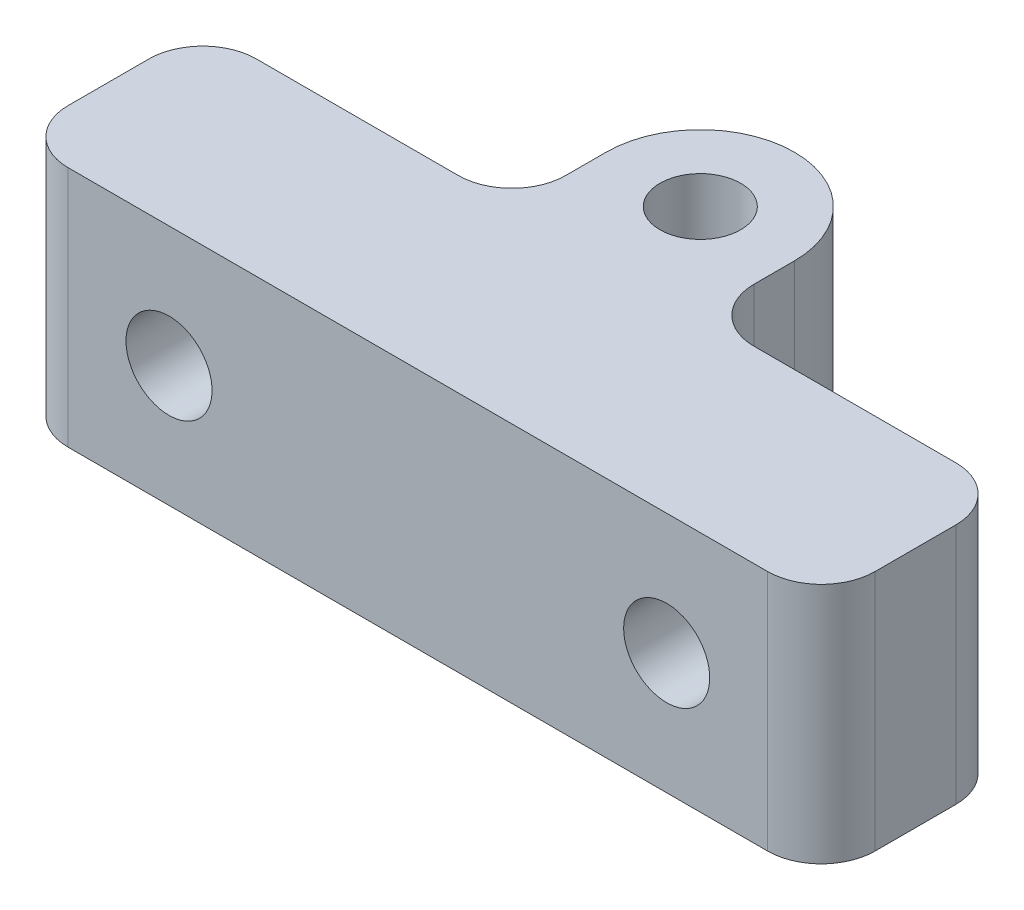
from build123d import *

# Parameters (mm, degrees)
SKETCH1_R           = 1.5
BOSS_EXTRUDE1_DEPTH = 9
FILLET1_R           = 2
SKETCH2_R           = 1.6
CUT_EXTRUDE1_DEPTH  = 19.841443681


with BuildPart() as part:
    # Sketch1 → Boss-Extrude1 (new body)
    with BuildSketch(Plane(origin=(0, 0, 0), x_dir=(1, 0, 0), z_dir=(0, 1, 0))):
        with BuildLine():
            Line((-15, -10.5), (15, -10.5))
            Line((15, -10.5), (15, -3.5))
            Line((15, -3.5), (3.5, -3.5))
            Line((3.5, -3.5), (3.5, 0))
            ThreePointArc((3.5, 0), (0, 3.5), (-3.5, 0))
            Line((-3.5, 0), (-3.5, -3.5))
            Line((-3.5, -3.5), (-15, -3.5))
            Line((-15, -3.5), (-15, -10.5))
        make_face()
        with Locations(Location((0, 0, 0), (0, 0, 270))):
            Circle(SKETCH1_R, mode=Mode.SUBTRACT)
    extrude(amount=BOSS_EXTRUDE1_DEPTH)

    # Fillet1
    fillet1_edges = [part.edges().sort_by_distance(p)[0] for p in [
        (-15, 4.5, 3.5),
        (-3.5, 4.5, 3.5),
        (3.5, 4.5, 3.5),
        (15, 4.5, 3.5),
        (15, 4.5, 10.5),
        (-15, 4.5, 10.5),
    ]]
    fillet(fillet1_edges, radius=FILLET1_R)

    # Sketch2 → Cut-Extrude1 (cut, through all)
    with BuildSketch(Plane(origin=(0, 0, 3.5), x_dir=(-1, 0, 0), z_dir=(0, 0, -1))):
        with Locations((-9.25, 4.5)):
            Circle(SKETCH2_R)
        with Locations((9.25, 4.5)):
            Circle(SKETCH2_R)
    extrude(amount=-CUT_EXTRUDE1_DEPTH, mode=Mode.SUBTRACT)


solid = part.part
